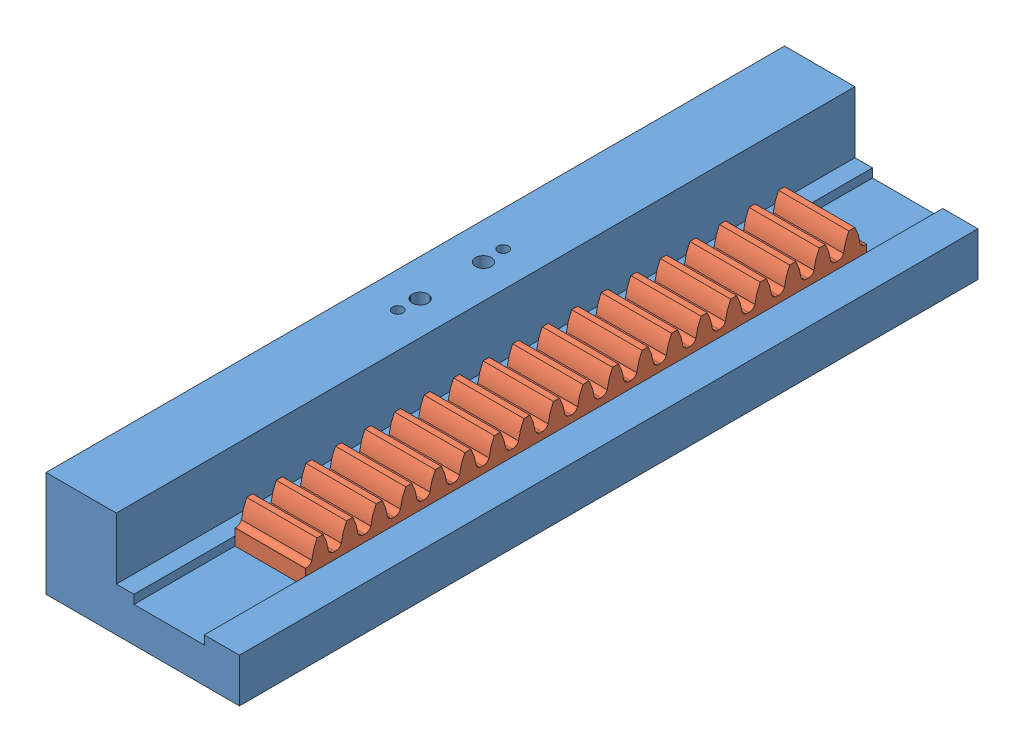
SolidWorks assembly ZB_Schiene.SLDASM, configuration Standard (file format 9000). Lengths in mm.
Overall size (110 60 420).
2 component instances, 2 part files, 2 mates.
Components (placement in the parent):
- schiene-1: schiene.SLDPRT [Standard] at (-65.4333 -16.3878 210) size (110 60 420)
- zahnstange-1: zahnstange.SLDPRT [Standard] at (24.5667 3.6122 253.3237) x (0 0 1) z (-1 0 0) size (319.2 20.69 40)
Mates (geometry in assembly coordinates):
- Deckungsgleich2: coincident anti-aligned: plane of schiene-1 through (24.5667 3.6122 630) normal (0 1 0); plane of zahnstange-1 through (-15.4333 3.6122 253.3237) normal (0 -1 0)
- Deckungsgleich3: coincident anti-aligned: plane of schiene-1 through (-15.4333 3.6122 630) normal (1 0 0); plane of zahnstange-1 through (-15.4333 3.6122 253.3237) normal (-1 0 0)
